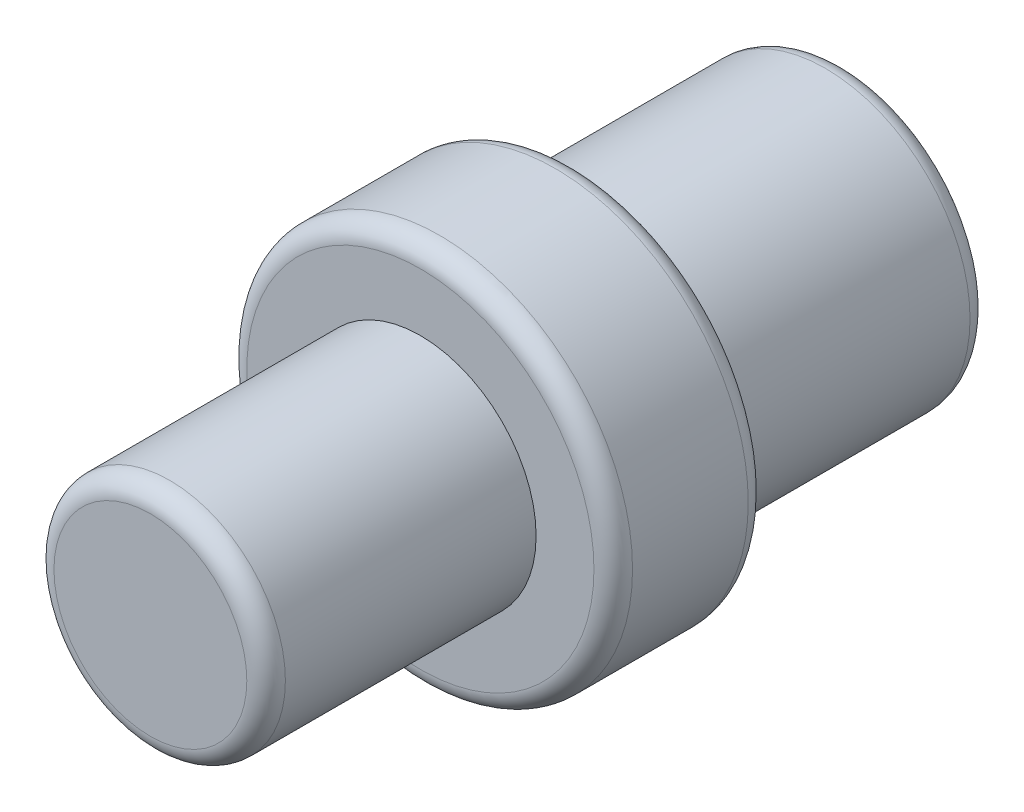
from build123d import *

# Parameters (mm, degrees)
ESQUISSE1_R      = 5
EXTRUSION1_DEPTH = 4
ESQUISSE2_R      = 3
EXTRUSION2_DEPTH = 7
ESQUISSE3_R      = 3.75
EXTRUSION3_DEPTH = 7
CONG_1_R         = 0.5


with BuildPart() as part:
    # Esquisse1 → Extrusion1 (new body)
    with BuildSketch(Plane.XY):
        Circle(ESQUISSE1_R)
    extrude(amount=EXTRUSION1_DEPTH)

    # Esquisse2 → Extrusion2 (add)
    with BuildSketch(Plane.XY.offset(4)):
        Circle(ESQUISSE2_R)
    extrude(amount=EXTRUSION2_DEPTH)

    # Esquisse3 → Extrusion3 (add)
    with BuildSketch(Plane(origin=(0, 0, 0), x_dir=(-1, 0, 0), z_dir=(0, 0, -1))):
        with Locations(Location((0, 0, 0), (0, 0, 180))):
            Circle(ESQUISSE3_R)
    extrude(amount=EXTRUSION3_DEPTH)

    # Cong_1
    cong_1_edges = [part.edges().sort_by_distance(p)[0] for p in [
        (-5, 0, 0),
        (-5, 0, 4),
        (-3.75, 0, -7),
        (-3, 0, 11),
    ]]
    fillet(cong_1_edges, radius=CONG_1_R)


solid = part.part
